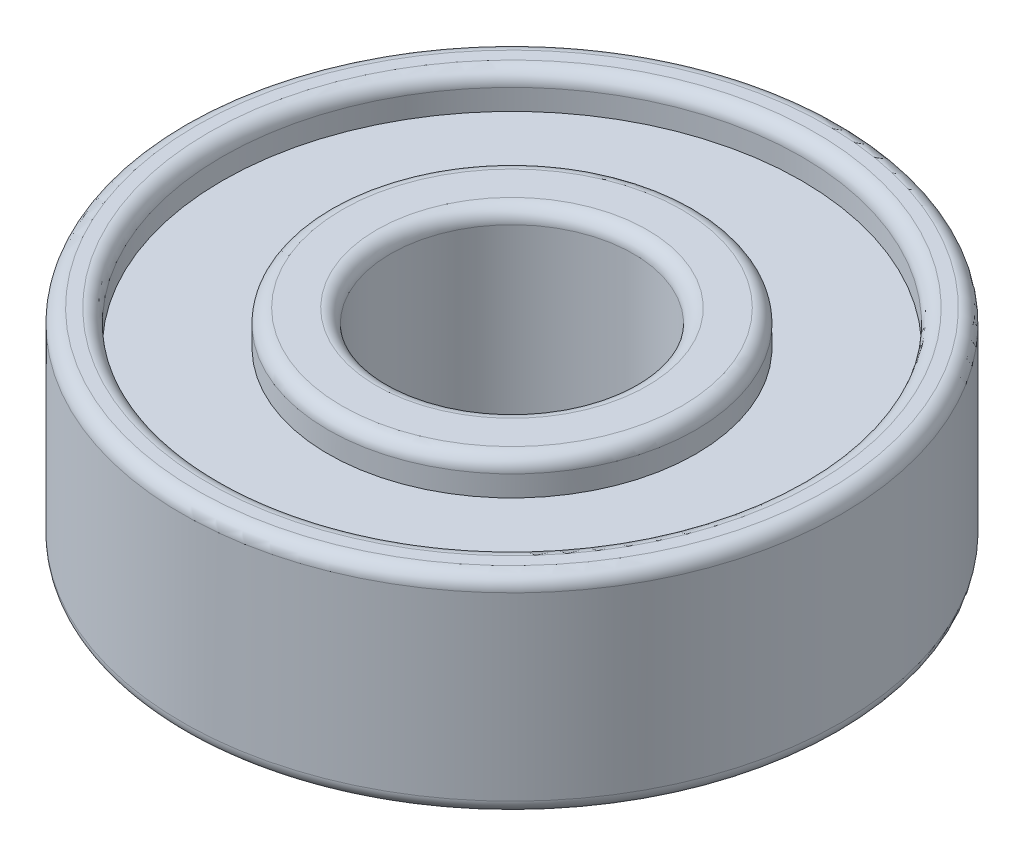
from build123d import *

# Parameters (mm, degrees)
CONG_1_R = 0.4


with BuildPart() as part:
    # Esquisse1 → R_volution1 (revolve)
    with BuildSketch(Plane.XY):
        Polygon((8.35, 0), (9.5, 0), (9.5, 6), (8.35, 6), (8.35, 5), (5.3, 5), (5.3, 6), (3.5, 6), (3.5, 0), (5.3, 0), (5.3, 1), (8.35, 1), align=None)
    revolve(axis=Axis((0, 0, 0), (0, 1, 0)))

    # Cong_1
    cong_1_edges = [part.edges().sort_by_distance(p)[0] for p in [
        (-3.5, 6, 0),
        (-3.5, 0, 0),
        (-5.3, 0, 0),
        (-8.35, 0, 0),
        (-9.5, 0, 0),
        (-9.5, 6, 0),
        (-8.35, 6, 0),
        (-5.3, 6, 0),
    ]]
    fillet(cong_1_edges, radius=CONG_1_R)


solid = part.part
